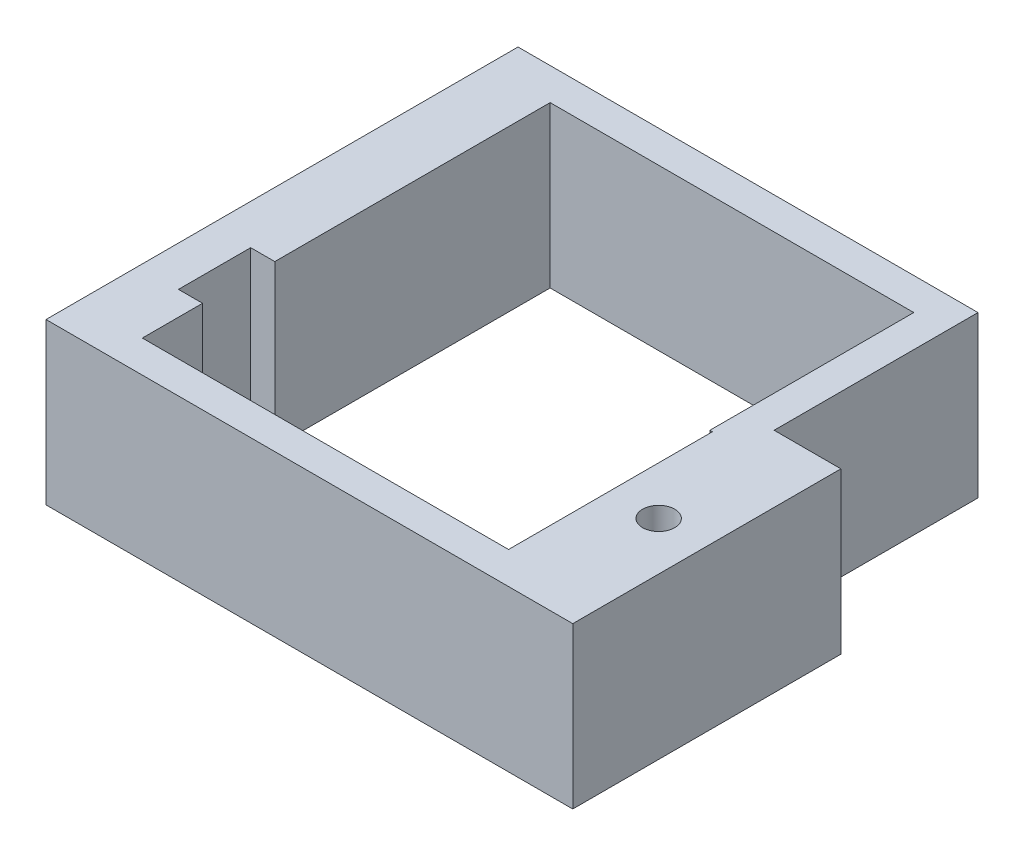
ISO-10303-21;
HEADER;
FILE_DESCRIPTION(('STEP AP214'),'2;1');
FILE_NAME('part.step','',(''),(''),'','','');
FILE_SCHEMA(('AUTOMOTIVE_DESIGN { 1 0 10303 214 1 1 1 1 }'));
ENDSEC;
DATA;
#1=APPLICATION_CONTEXT('core data for automotive mechanical design processes');
#2=APPLICATION_PROTOCOL_DEFINITION('international standard','automotive_design',2000,#1);
#3=PRODUCT_CONTEXT('',#1,'mechanical');
#4=PRODUCT('Part','Part','',(#3));
#5=PRODUCT_RELATED_PRODUCT_CATEGORY('part','',(#4));
#6=PRODUCT_DEFINITION_FORMATION('','',#4);
#7=PRODUCT_DEFINITION_CONTEXT('part definition',#1,'design');
#8=PRODUCT_DEFINITION('design','',#6,#7);
#9=PRODUCT_DEFINITION_SHAPE('','',#8);
#10=(LENGTH_UNIT() NAMED_UNIT(*) SI_UNIT(.MILLI.,.METRE.));
#11=(NAMED_UNIT(*) PLANE_ANGLE_UNIT() SI_UNIT($,.RADIAN.));
#12=(NAMED_UNIT(*) SI_UNIT($,.STERADIAN.) SOLID_ANGLE_UNIT());
#13=UNCERTAINTY_MEASURE_WITH_UNIT(LENGTH_MEASURE(1.E-05),#10,'distance_accuracy_value','');
#14=(GEOMETRIC_REPRESENTATION_CONTEXT(3) GLOBAL_UNCERTAINTY_ASSIGNED_CONTEXT((#13)) GLOBAL_UNIT_ASSIGNED_CONTEXT((#10,
#11,#12)) REPRESENTATION_CONTEXT('',''));
#15=CARTESIAN_POINT('',(0.,0.,0.));
#16=DIRECTION('',(0.,0.,1.));
#17=DIRECTION('',(1.,0.,0.));
#18=AXIS2_PLACEMENT_3D('',#15,#16,#17);
#19=CARTESIAN_POINT('',(4.,10.,-27.4));
#20=DIRECTION('',(1.,0.,0.));
#21=DIRECTION('',(0.,0.,-1.));
#22=AXIS2_PLACEMENT_3D('',#19,#20,#21);
#23=PLANE('',#22);
#24=DIRECTION('',(0.,1.,0.));
#25=VECTOR('',#24,1.);
#26=CARTESIAN_POINT('',(4.,0.,-5.75000000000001));
#27=LINE('',#26,#25);
#28=CARTESIAN_POINT('',(4.,0.,-5.75000000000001));
#29=VERTEX_POINT('',#28);
#30=CARTESIAN_POINT('',(4.,10.,-5.75000000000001));
#31=VERTEX_POINT('',#30);
#32=EDGE_CURVE('E179',#29,#31,#27,.T.);
#33=ORIENTED_EDGE('',*,*,#32,.T.);
#34=DIRECTION('',(0.,0.,1.));
#35=VECTOR('',#34,1.);
#36=CARTESIAN_POINT('',(4.,10.,-27.4));
#37=LINE('',#36,#35);
#38=CARTESIAN_POINT('',(4.,10.,-2.));
#39=VERTEX_POINT('',#38);
#40=EDGE_CURVE('E56',#31,#39,#37,.T.);
#41=ORIENTED_EDGE('',*,*,#40,.T.);
#42=DIRECTION('',(0.,-1.,0.));
#43=VECTOR('',#42,1.);
#44=CARTESIAN_POINT('',(4.,10.,-2.));
#45=LINE('',#44,#43);
#46=CARTESIAN_POINT('',(4.,0.,-2.));
#47=VERTEX_POINT('',#46);
#48=EDGE_CURVE('E220',#39,#47,#45,.T.);
#49=ORIENTED_EDGE('',*,*,#48,.T.);
#50=DIRECTION('',(0.,0.,1.));
#51=VECTOR('',#50,1.);
#52=CARTESIAN_POINT('',(4.,0.,-27.4));
#53=LINE('',#52,#51);
#54=EDGE_CURVE('E215',#29,#47,#53,.T.);
#55=ORIENTED_EDGE('',*,*,#54,.F.);
#56=EDGE_LOOP('',(#33,#41,#49,#55));
#57=FACE_BOUND('',#56,.T.);
#58=ADVANCED_FACE('F33',(#57),#23,.T.);
#59=CARTESIAN_POINT('',(0.,10.,0.));
#60=DIRECTION('',(0.,-1.,0.));
#61=DIRECTION('',(0.,0.,-1.));
#62=AXIS2_PLACEMENT_3D('',#59,#60,#61);
#63=PLANE('',#62);
#64=CARTESIAN_POINT('',(29.81,10.,-8.35));
#65=DIRECTION('',(0.,1.,0.));
#66=DIRECTION('',(0.,0.,1.));
#67=AXIS2_PLACEMENT_3D('',#64,#65,#66);
#68=CIRCLE('',#67,1.);
#69=CARTESIAN_POINT('',(29.81,10.,-7.35));
#70=VERTEX_POINT('',#69);
#71=EDGE_CURVE('E181',#70,#70,#68,.T.);
#72=ORIENTED_EDGE('',*,*,#71,.F.);
#73=EDGE_LOOP('',(#72));
#74=FACE_BOUND('',#73,.T.);
#75=DIRECTION('',(1.,0.,0.));
#76=VECTOR('',#75,1.);
#77=CARTESIAN_POINT('',(32.81,10.,0.));
#78=LINE('',#77,#76);
#79=CARTESIAN_POINT('',(0.,10.,0.));
#80=VERTEX_POINT('',#79);
#81=CARTESIAN_POINT('',(32.81,10.,0.));
#82=VERTEX_POINT('',#81);
#83=EDGE_CURVE('E231',#80,#82,#78,.T.);
#84=ORIENTED_EDGE('',*,*,#83,.T.);
#85=DIRECTION('',(0.,0.,-1.));
#86=VECTOR('',#85,1.);
#87=CARTESIAN_POINT('',(32.81,10.,-16.7));
#88=LINE('',#87,#86);
#89=CARTESIAN_POINT('',(32.81,10.,-16.7));
#90=VERTEX_POINT('',#89);
#91=EDGE_CURVE('E234',#82,#90,#88,.T.);
#92=ORIENTED_EDGE('',*,*,#91,.T.);
#93=DIRECTION('',(-1.,0.,0.));
#94=VECTOR('',#93,1.);
#95=CARTESIAN_POINT('',(28.65,10.,-16.7));
#96=LINE('',#95,#94);
#97=CARTESIAN_POINT('',(28.65,10.,-16.7));
#98=VERTEX_POINT('',#97);
#99=EDGE_CURVE('E237',#90,#98,#96,.T.);
#100=ORIENTED_EDGE('',*,*,#99,.T.);
#101=DIRECTION('',(0.,0.,-1.));
#102=VECTOR('',#101,1.);
#103=CARTESIAN_POINT('',(28.65,10.,-29.4));
#104=LINE('',#103,#102);
#105=CARTESIAN_POINT('',(28.65,10.,-29.4));
#106=VERTEX_POINT('',#105);
#107=EDGE_CURVE('E239',#98,#106,#104,.T.);
#108=ORIENTED_EDGE('',*,*,#107,.T.);
#109=DIRECTION('',(-1.,0.,0.));
#110=VECTOR('',#109,1.);
#111=CARTESIAN_POINT('',(0.,10.,-29.4));
#112=LINE('',#111,#110);
#113=CARTESIAN_POINT('',(0.,10.,-29.4));
#114=VERTEX_POINT('',#113);
#115=EDGE_CURVE('E241',#106,#114,#112,.T.);
#116=ORIENTED_EDGE('',*,*,#115,.T.);
#117=DIRECTION('',(0.,0.,1.));
#118=VECTOR('',#117,1.);
#119=CARTESIAN_POINT('',(0.,10.,0.));
#120=LINE('',#119,#118);
#121=EDGE_CURVE('E243',#114,#80,#120,.T.);
#122=ORIENTED_EDGE('',*,*,#121,.T.);
#123=EDGE_LOOP('',(#84,#92,#100,#108,#116,#122));
#124=FACE_BOUND('',#123,.T.);
#125=ORIENTED_EDGE('',*,*,#40,.F.);
#126=DIRECTION('',(1.,0.,0.));
#127=VECTOR('',#126,1.);
#128=CARTESIAN_POINT('',(4.,10.,-5.75000000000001));
#129=LINE('',#128,#127);
#130=CARTESIAN_POINT('',(2.5,10.,-5.75000000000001));
#131=VERTEX_POINT('',#130);
#132=EDGE_CURVE('E171',#131,#31,#129,.T.);
#133=ORIENTED_EDGE('',*,*,#132,.F.);
#134=DIRECTION('',(0.,0.,1.));
#135=VECTOR('',#134,1.);
#136=CARTESIAN_POINT('',(2.5,10.,-10.25));
#137=LINE('',#136,#135);
#138=CARTESIAN_POINT('',(2.5,10.,-10.25));
#139=VERTEX_POINT('',#138);
#140=EDGE_CURVE('E173',#139,#131,#137,.T.);
#141=ORIENTED_EDGE('',*,*,#140,.F.);
#142=DIRECTION('',(-1.,0.,0.));
#143=VECTOR('',#142,1.);
#144=CARTESIAN_POINT('',(4.,10.,-10.25));
#145=LINE('',#144,#143);
#146=CARTESIAN_POINT('',(4.,10.,-10.25));
#147=VERTEX_POINT('',#146);
#148=EDGE_CURVE('E150',#147,#139,#145,.T.);
#149=ORIENTED_EDGE('',*,*,#148,.F.);
#150=CARTESIAN_POINT('',(4.,10.,-27.4));
#151=VERTEX_POINT('',#150);
#152=EDGE_CURVE('E199',#151,#147,#37,.T.);
#153=ORIENTED_EDGE('',*,*,#152,.F.);
#154=DIRECTION('',(-1.,0.,0.));
#155=VECTOR('',#154,1.);
#156=CARTESIAN_POINT('',(26.65,10.,-27.4));
#157=LINE('',#156,#155);
#158=CARTESIAN_POINT('',(26.65,10.,-27.4));
#159=VERTEX_POINT('',#158);
#160=EDGE_CURVE('E197',#159,#151,#157,.T.);
#161=ORIENTED_EDGE('',*,*,#160,.F.);
#162=DIRECTION('',(0.,0.,-1.));
#163=VECTOR('',#162,1.);
#164=CARTESIAN_POINT('',(26.65,10.,-14.7));
#165=LINE('',#164,#163);
#166=CARTESIAN_POINT('',(26.65,10.,-14.7));
#167=VERTEX_POINT('',#166);
#168=EDGE_CURVE('E195',#167,#159,#165,.T.);
#169=ORIENTED_EDGE('',*,*,#168,.F.);
#170=DIRECTION('',(-1.,0.,0.));
#171=VECTOR('',#170,1.);
#172=CARTESIAN_POINT('',(26.81,10.,-14.7));
#173=LINE('',#172,#171);
#174=CARTESIAN_POINT('',(26.81,10.,-14.7));
#175=VERTEX_POINT('',#174);
#176=EDGE_CURVE('E192',#175,#167,#173,.T.);
#177=ORIENTED_EDGE('',*,*,#176,.F.);
#178=DIRECTION('',(0.,0.,-1.));
#179=VECTOR('',#178,1.);
#180=CARTESIAN_POINT('',(26.81,10.,-2.));
#181=LINE('',#180,#179);
#182=CARTESIAN_POINT('',(26.81,10.,-2.));
#183=VERTEX_POINT('',#182);
#184=EDGE_CURVE('E190',#183,#175,#181,.T.);
#185=ORIENTED_EDGE('',*,*,#184,.F.);
#186=DIRECTION('',(1.,0.,0.));
#187=VECTOR('',#186,1.);
#188=CARTESIAN_POINT('',(4.,10.,-2.));
#189=LINE('',#188,#187);
#190=EDGE_CURVE('E202',#39,#183,#189,.T.);
#191=ORIENTED_EDGE('',*,*,#190,.F.);
#192=EDGE_LOOP('',(#125,#133,#141,#149,#153,#161,#169,#177,#185,#191));
#193=FACE_BOUND('',#192,.T.);
#194=ADVANCED_FACE('F290',(#74,#124,#193),#63,.F.);
#195=CARTESIAN_POINT('',(0.,0.,0.));
#196=DIRECTION('',(0.,-1.,0.));
#197=DIRECTION('',(0.,0.,-1.));
#198=AXIS2_PLACEMENT_3D('',#195,#196,#197);
#199=PLANE('',#198);
#200=DIRECTION('',(1.,0.,0.));
#201=VECTOR('',#200,1.);
#202=CARTESIAN_POINT('',(4.,0.,-5.75000000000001));
#203=LINE('',#202,#201);
#204=CARTESIAN_POINT('',(2.5,0.,-5.75000000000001));
#205=VERTEX_POINT('',#204);
#206=EDGE_CURVE('E163',#205,#29,#203,.T.);
#207=ORIENTED_EDGE('',*,*,#206,.T.);
#208=ORIENTED_EDGE('',*,*,#54,.T.);
#209=DIRECTION('',(1.,0.,0.));
#210=VECTOR('',#209,1.);
#211=CARTESIAN_POINT('',(4.,0.,-2.));
#212=LINE('',#211,#210);
#213=CARTESIAN_POINT('',(26.81,0.,-2.));
#214=VERTEX_POINT('',#213);
#215=EDGE_CURVE('E193',#47,#214,#212,.T.);
#216=ORIENTED_EDGE('',*,*,#215,.T.);
#217=DIRECTION('',(0.,0.,-1.));
#218=VECTOR('',#217,1.);
#219=CARTESIAN_POINT('',(26.81,0.,-6.73909948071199));
#220=LINE('',#219,#218);
#221=CARTESIAN_POINT('',(26.81,0.,-14.7));
#222=VERTEX_POINT('',#221);
#223=EDGE_CURVE('E187',#214,#222,#220,.T.);
#224=ORIENTED_EDGE('',*,*,#223,.T.);
#225=DIRECTION('',(-1.,0.,0.));
#226=VECTOR('',#225,1.);
#227=CARTESIAN_POINT('',(26.81,0.,-14.7));
#228=LINE('',#227,#226);
#229=CARTESIAN_POINT('',(26.65,0.,-14.7));
#230=VERTEX_POINT('',#229);
#231=EDGE_CURVE('E207',#222,#230,#228,.T.);
#232=ORIENTED_EDGE('',*,*,#231,.T.);
#233=DIRECTION('',(0.,0.,-1.));
#234=VECTOR('',#233,1.);
#235=CARTESIAN_POINT('',(26.65,0.,-14.7));
#236=LINE('',#235,#234);
#237=CARTESIAN_POINT('',(26.65,0.,-27.4));
#238=VERTEX_POINT('',#237);
#239=EDGE_CURVE('E210',#230,#238,#236,.T.);
#240=ORIENTED_EDGE('',*,*,#239,.T.);
#241=DIRECTION('',(-1.,0.,0.));
#242=VECTOR('',#241,1.);
#243=CARTESIAN_POINT('',(26.65,0.,-27.4));
#244=LINE('',#243,#242);
#245=CARTESIAN_POINT('',(4.,0.,-27.4));
#246=VERTEX_POINT('',#245);
#247=EDGE_CURVE('E213',#238,#246,#244,.T.);
#248=ORIENTED_EDGE('',*,*,#247,.T.);
#249=CARTESIAN_POINT('',(4.,0.,-10.25));
#250=VERTEX_POINT('',#249);
#251=EDGE_CURVE('E170',#246,#250,#53,.T.);
#252=ORIENTED_EDGE('',*,*,#251,.T.);
#253=DIRECTION('',(-1.,0.,0.));
#254=VECTOR('',#253,1.);
#255=CARTESIAN_POINT('',(4.,0.,-10.25));
#256=LINE('',#255,#254);
#257=CARTESIAN_POINT('',(2.5,0.,-10.25));
#258=VERTEX_POINT('',#257);
#259=EDGE_CURVE('E48',#250,#258,#256,.T.);
#260=ORIENTED_EDGE('',*,*,#259,.T.);
#261=DIRECTION('',(0.,0.,1.));
#262=VECTOR('',#261,1.);
#263=CARTESIAN_POINT('',(2.5,0.,-10.25));
#264=LINE('',#263,#262);
#265=EDGE_CURVE('E158',#258,#205,#264,.T.);
#266=ORIENTED_EDGE('',*,*,#265,.T.);
#267=EDGE_LOOP('',(#207,#208,#216,#224,#232,#240,#248,#252,#260,#266));
#268=FACE_BOUND('',#267,.T.);
#269=CARTESIAN_POINT('',(29.81,0.,-8.35));
#270=DIRECTION('',(0.,1.,0.));
#271=DIRECTION('',(0.,0.,1.));
#272=AXIS2_PLACEMENT_3D('',#269,#270,#271);
#273=CIRCLE('',#272,1.);
#274=CARTESIAN_POINT('',(29.81,0.,-7.35));
#275=VERTEX_POINT('',#274);
#276=EDGE_CURVE('E184',#275,#275,#273,.T.);
#277=ORIENTED_EDGE('',*,*,#276,.T.);
#278=EDGE_LOOP('',(#277));
#279=FACE_BOUND('',#278,.T.);
#280=DIRECTION('',(1.,0.,0.));
#281=VECTOR('',#280,1.);
#282=CARTESIAN_POINT('',(32.81,0.,0.));
#283=LINE('',#282,#281);
#284=CARTESIAN_POINT('',(0.,0.,0.));
#285=VERTEX_POINT('',#284);
#286=CARTESIAN_POINT('',(32.81,0.,0.));
#287=VERTEX_POINT('',#286);
#288=EDGE_CURVE('E230',#285,#287,#283,.T.);
#289=ORIENTED_EDGE('',*,*,#288,.F.);
#290=DIRECTION('',(0.,0.,1.));
#291=VECTOR('',#290,1.);
#292=CARTESIAN_POINT('',(0.,0.,0.));
#293=LINE('',#292,#291);
#294=CARTESIAN_POINT('',(0.,0.,-29.4));
#295=VERTEX_POINT('',#294);
#296=EDGE_CURVE('E235',#295,#285,#293,.T.);
#297=ORIENTED_EDGE('',*,*,#296,.F.);
#298=DIRECTION('',(-1.,0.,0.));
#299=VECTOR('',#298,1.);
#300=CARTESIAN_POINT('',(0.,0.,-29.4));
#301=LINE('',#300,#299);
#302=CARTESIAN_POINT('',(28.65,0.,-29.4));
#303=VERTEX_POINT('',#302);
#304=EDGE_CURVE('E254',#303,#295,#301,.T.);
#305=ORIENTED_EDGE('',*,*,#304,.F.);
#306=DIRECTION('',(0.,0.,-1.));
#307=VECTOR('',#306,1.);
#308=CARTESIAN_POINT('',(28.65,0.,-29.4));
#309=LINE('',#308,#307);
#310=CARTESIAN_POINT('',(28.65,0.,-16.7));
#311=VERTEX_POINT('',#310);
#312=EDGE_CURVE('E252',#311,#303,#309,.T.);
#313=ORIENTED_EDGE('',*,*,#312,.F.);
#314=DIRECTION('',(-1.,0.,0.));
#315=VECTOR('',#314,1.);
#316=CARTESIAN_POINT('',(28.65,0.,-16.7));
#317=LINE('',#316,#315);
#318=CARTESIAN_POINT('',(32.81,0.,-16.7));
#319=VERTEX_POINT('',#318);
#320=EDGE_CURVE('E250',#319,#311,#317,.T.);
#321=ORIENTED_EDGE('',*,*,#320,.F.);
#322=DIRECTION('',(0.,0.,-1.));
#323=VECTOR('',#322,1.);
#324=CARTESIAN_POINT('',(32.81,0.,-16.7));
#325=LINE('',#324,#323);
#326=EDGE_CURVE('E248',#287,#319,#325,.T.);
#327=ORIENTED_EDGE('',*,*,#326,.F.);
#328=EDGE_LOOP('',(#289,#297,#305,#313,#321,#327));
#329=FACE_BOUND('',#328,.T.);
#330=ADVANCED_FACE('F166',(#268,#279,#329),#199,.T.);
#331=CARTESIAN_POINT('',(32.81,10.,0.));
#332=DIRECTION('',(0.,0.,-1.));
#333=DIRECTION('',(-1.,0.,0.));
#334=AXIS2_PLACEMENT_3D('',#331,#332,#333);
#335=PLANE('',#334);
#336=ORIENTED_EDGE('',*,*,#288,.T.);
#337=DIRECTION('',(0.,-1.,0.));
#338=VECTOR('',#337,1.);
#339=CARTESIAN_POINT('',(32.81,10.,0.));
#340=LINE('',#339,#338);
#341=EDGE_CURVE('E11',#82,#287,#340,.T.);
#342=ORIENTED_EDGE('',*,*,#341,.F.);
#343=ORIENTED_EDGE('',*,*,#83,.F.);
#344=DIRECTION('',(0.,-1.,0.));
#345=VECTOR('',#344,1.);
#346=CARTESIAN_POINT('',(0.,10.,0.));
#347=LINE('',#346,#345);
#348=EDGE_CURVE('E245',#80,#285,#347,.T.);
#349=ORIENTED_EDGE('',*,*,#348,.T.);
#350=EDGE_LOOP('',(#336,#342,#343,#349));
#351=FACE_BOUND('',#350,.T.);
#352=ADVANCED_FACE('F35',(#351),#335,.F.);
#353=CARTESIAN_POINT('',(32.81,10.,-16.7));
#354=DIRECTION('',(-1.,0.,0.));
#355=DIRECTION('',(0.,0.,1.));
#356=AXIS2_PLACEMENT_3D('',#353,#354,#355);
#357=PLANE('',#356);
#358=ORIENTED_EDGE('',*,*,#326,.T.);
#359=DIRECTION('',(0.,-1.,0.));
#360=VECTOR('',#359,1.);
#361=CARTESIAN_POINT('',(32.81,10.,-16.7));
#362=LINE('',#361,#360);
#363=EDGE_CURVE('E41',#90,#319,#362,.T.);
#364=ORIENTED_EDGE('',*,*,#363,.F.);
#365=ORIENTED_EDGE('',*,*,#91,.F.);
#366=ORIENTED_EDGE('',*,*,#341,.T.);
#367=EDGE_LOOP('',(#358,#364,#365,#366));
#368=FACE_BOUND('',#367,.T.);
#369=ADVANCED_FACE('F295',(#368),#357,.F.);
#370=CARTESIAN_POINT('',(28.65,10.,-16.7));
#371=DIRECTION('',(0.,0.,1.));
#372=DIRECTION('',(1.,0.,0.));
#373=AXIS2_PLACEMENT_3D('',#370,#371,#372);
#374=PLANE('',#373);
#375=ORIENTED_EDGE('',*,*,#320,.T.);
#376=DIRECTION('',(0.,-1.,0.));
#377=VECTOR('',#376,1.);
#378=CARTESIAN_POINT('',(28.65,10.,-16.7));
#379=LINE('',#378,#377);
#380=EDGE_CURVE('E265',#98,#311,#379,.T.);
#381=ORIENTED_EDGE('',*,*,#380,.F.);
#382=ORIENTED_EDGE('',*,*,#99,.F.);
#383=ORIENTED_EDGE('',*,*,#363,.T.);
#384=EDGE_LOOP('',(#375,#381,#382,#383));
#385=FACE_BOUND('',#384,.T.);
#386=ADVANCED_FACE('F272',(#385),#374,.F.);
#387=CARTESIAN_POINT('',(28.65,10.,-29.4));
#388=DIRECTION('',(-1.,0.,0.));
#389=DIRECTION('',(0.,0.,1.));
#390=AXIS2_PLACEMENT_3D('',#387,#388,#389);
#391=PLANE('',#390);
#392=ORIENTED_EDGE('',*,*,#312,.T.);
#393=DIRECTION('',(0.,-1.,0.));
#394=VECTOR('',#393,1.);
#395=CARTESIAN_POINT('',(28.65,10.,-29.4));
#396=LINE('',#395,#394);
#397=EDGE_CURVE('E262',#106,#303,#396,.T.);
#398=ORIENTED_EDGE('',*,*,#397,.F.);
#399=ORIENTED_EDGE('',*,*,#107,.F.);
#400=ORIENTED_EDGE('',*,*,#380,.T.);
#401=EDGE_LOOP('',(#392,#398,#399,#400));
#402=FACE_BOUND('',#401,.T.);
#403=ADVANCED_FACE('F282',(#402),#391,.F.);
#404=CARTESIAN_POINT('',(0.,10.,-29.4));
#405=DIRECTION('',(0.,0.,1.));
#406=DIRECTION('',(1.,0.,0.));
#407=AXIS2_PLACEMENT_3D('',#404,#405,#406);
#408=PLANE('',#407);
#409=ORIENTED_EDGE('',*,*,#304,.T.);
#410=DIRECTION('',(0.,-1.,0.));
#411=VECTOR('',#410,1.);
#412=CARTESIAN_POINT('',(0.,10.,-29.4));
#413=LINE('',#412,#411);
#414=EDGE_CURVE('E259',#114,#295,#413,.T.);
#415=ORIENTED_EDGE('',*,*,#414,.F.);
#416=ORIENTED_EDGE('',*,*,#115,.F.);
#417=ORIENTED_EDGE('',*,*,#397,.T.);
#418=EDGE_LOOP('',(#409,#415,#416,#417));
#419=FACE_BOUND('',#418,.T.);
#420=ADVANCED_FACE('F286',(#419),#408,.F.);
#421=CARTESIAN_POINT('',(0.,10.,0.));
#422=DIRECTION('',(1.,0.,0.));
#423=DIRECTION('',(0.,0.,-1.));
#424=AXIS2_PLACEMENT_3D('',#421,#422,#423);
#425=PLANE('',#424);
#426=ORIENTED_EDGE('',*,*,#296,.T.);
#427=ORIENTED_EDGE('',*,*,#348,.F.);
#428=ORIENTED_EDGE('',*,*,#121,.F.);
#429=ORIENTED_EDGE('',*,*,#414,.T.);
#430=EDGE_LOOP('',(#426,#427,#428,#429));
#431=FACE_BOUND('',#430,.T.);
#432=ADVANCED_FACE('F298',(#431),#425,.F.);
#433=CARTESIAN_POINT('',(26.81,10.,-6.73909948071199));
#434=DIRECTION('',(-1.,0.,0.));
#435=DIRECTION('',(0.,0.,1.));
#436=AXIS2_PLACEMENT_3D('',#433,#434,#435);
#437=PLANE('',#436);
#438=ORIENTED_EDGE('',*,*,#223,.F.);
#439=DIRECTION('',(0.,-1.,0.));
#440=VECTOR('',#439,1.);
#441=CARTESIAN_POINT('',(26.81,10.,-2.));
#442=LINE('',#441,#440);
#443=EDGE_CURVE('E204',#183,#214,#442,.T.);
#444=ORIENTED_EDGE('',*,*,#443,.F.);
#445=ORIENTED_EDGE('',*,*,#184,.T.);
#446=DIRECTION('',(0.,-1.,0.));
#447=VECTOR('',#446,1.);
#448=CARTESIAN_POINT('',(26.81,10.,-14.7));
#449=LINE('',#448,#447);
#450=EDGE_CURVE('E228',#175,#222,#449,.T.);
#451=ORIENTED_EDGE('',*,*,#450,.T.);
#452=EDGE_LOOP('',(#438,#444,#445,#451));
#453=FACE_BOUND('',#452,.T.);
#454=ADVANCED_FACE('F300',(#453),#437,.T.);
#455=CARTESIAN_POINT('',(26.81,10.,-14.7));
#456=DIRECTION('',(0.,0.,1.));
#457=DIRECTION('',(1.,0.,0.));
#458=AXIS2_PLACEMENT_3D('',#455,#456,#457);
#459=PLANE('',#458);
#460=ORIENTED_EDGE('',*,*,#231,.F.);
#461=ORIENTED_EDGE('',*,*,#450,.F.);
#462=ORIENTED_EDGE('',*,*,#176,.T.);
#463=DIRECTION('',(0.,-1.,0.));
#464=VECTOR('',#463,1.);
#465=CARTESIAN_POINT('',(26.65,10.,-14.7));
#466=LINE('',#465,#464);
#467=EDGE_CURVE('E226',#167,#230,#466,.T.);
#468=ORIENTED_EDGE('',*,*,#467,.T.);
#469=EDGE_LOOP('',(#460,#461,#462,#468));
#470=FACE_BOUND('',#469,.T.);
#471=ADVANCED_FACE('F306',(#470),#459,.T.);
#472=CARTESIAN_POINT('',(26.65,10.,-14.7));
#473=DIRECTION('',(-1.,0.,0.));
#474=DIRECTION('',(0.,0.,1.));
#475=AXIS2_PLACEMENT_3D('',#472,#473,#474);
#476=PLANE('',#475);
#477=ORIENTED_EDGE('',*,*,#239,.F.);
#478=ORIENTED_EDGE('',*,*,#467,.F.);
#479=ORIENTED_EDGE('',*,*,#168,.T.);
#480=DIRECTION('',(0.,-1.,0.));
#481=VECTOR('',#480,1.);
#482=CARTESIAN_POINT('',(26.65,10.,-27.4));
#483=LINE('',#482,#481);
#484=EDGE_CURVE('E224',#159,#238,#483,.T.);
#485=ORIENTED_EDGE('',*,*,#484,.T.);
#486=EDGE_LOOP('',(#477,#478,#479,#485));
#487=FACE_BOUND('',#486,.T.);
#488=ADVANCED_FACE('F331',(#487),#476,.T.);
#489=CARTESIAN_POINT('',(26.65,10.,-27.4));
#490=DIRECTION('',(0.,0.,1.));
#491=DIRECTION('',(1.,0.,0.));
#492=AXIS2_PLACEMENT_3D('',#489,#490,#491);
#493=PLANE('',#492);
#494=ORIENTED_EDGE('',*,*,#247,.F.);
#495=ORIENTED_EDGE('',*,*,#484,.F.);
#496=ORIENTED_EDGE('',*,*,#160,.T.);
#497=DIRECTION('',(0.,-1.,0.));
#498=VECTOR('',#497,1.);
#499=CARTESIAN_POINT('',(4.,10.,-27.4));
#500=LINE('',#499,#498);
#501=EDGE_CURVE('E222',#151,#246,#500,.T.);
#502=ORIENTED_EDGE('',*,*,#501,.T.);
#503=EDGE_LOOP('',(#494,#495,#496,#502));
#504=FACE_BOUND('',#503,.T.);
#505=ADVANCED_FACE('F323',(#504),#493,.T.);
#506=DIRECTION('',(0.,1.,0.));
#507=VECTOR('',#506,1.);
#508=CARTESIAN_POINT('',(4.,0.,-10.25));
#509=LINE('',#508,#507);
#510=EDGE_CURVE('E155',#250,#147,#509,.T.);
#511=ORIENTED_EDGE('',*,*,#510,.F.);
#512=ORIENTED_EDGE('',*,*,#251,.F.);
#513=ORIENTED_EDGE('',*,*,#501,.F.);
#514=ORIENTED_EDGE('',*,*,#152,.T.);
#515=EDGE_LOOP('',(#511,#512,#513,#514));
#516=FACE_BOUND('',#515,.T.);
#517=ADVANCED_FACE('F313',(#516),#23,.T.);
#518=CARTESIAN_POINT('',(4.,10.,-2.));
#519=DIRECTION('',(0.,0.,-1.));
#520=DIRECTION('',(-1.,0.,0.));
#521=AXIS2_PLACEMENT_3D('',#518,#519,#520);
#522=PLANE('',#521);
#523=ORIENTED_EDGE('',*,*,#215,.F.);
#524=ORIENTED_EDGE('',*,*,#48,.F.);
#525=ORIENTED_EDGE('',*,*,#190,.T.);
#526=ORIENTED_EDGE('',*,*,#443,.T.);
#527=EDGE_LOOP('',(#523,#524,#525,#526));
#528=FACE_BOUND('',#527,.T.);
#529=ADVANCED_FACE('F322',(#528),#522,.T.);
#530=CARTESIAN_POINT('',(29.81,0.,-8.35));
#531=DIRECTION('',(0.,1.,0.));
#532=DIRECTION('',(0.,0.,1.));
#533=AXIS2_PLACEMENT_3D('',#530,#531,#532);
#534=CYLINDRICAL_SURFACE('',#533,1.);
#535=ORIENTED_EDGE('',*,*,#276,.F.);
#536=EDGE_LOOP('',(#535));
#537=FACE_BOUND('',#536,.T.);
#538=ORIENTED_EDGE('',*,*,#71,.T.);
#539=EDGE_LOOP('',(#538));
#540=FACE_BOUND('',#539,.T.);
#541=ADVANCED_FACE('F329',(#537,#540),#534,.F.);
#542=CARTESIAN_POINT('',(4.,0.,-5.75000000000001));
#543=DIRECTION('',(0.,0.,1.));
#544=DIRECTION('',(1.,0.,0.));
#545=AXIS2_PLACEMENT_3D('',#542,#543,#544);
#546=PLANE('',#545);
#547=ORIENTED_EDGE('',*,*,#132,.T.);
#548=ORIENTED_EDGE('',*,*,#32,.F.);
#549=ORIENTED_EDGE('',*,*,#206,.F.);
#550=DIRECTION('',(0.,1.,0.));
#551=VECTOR('',#550,1.);
#552=CARTESIAN_POINT('',(2.5,0.,-5.75000000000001));
#553=LINE('',#552,#551);
#554=EDGE_CURVE('E154',#205,#131,#553,.T.);
#555=ORIENTED_EDGE('',*,*,#554,.T.);
#556=EDGE_LOOP('',(#547,#548,#549,#555));
#557=FACE_BOUND('',#556,.T.);
#558=ADVANCED_FACE('F339',(#557),#546,.F.);
#559=CARTESIAN_POINT('',(2.5,0.,-10.25));
#560=DIRECTION('',(-1.,0.,0.));
#561=DIRECTION('',(0.,0.,1.));
#562=AXIS2_PLACEMENT_3D('',#559,#560,#561);
#563=PLANE('',#562);
#564=ORIENTED_EDGE('',*,*,#140,.T.);
#565=ORIENTED_EDGE('',*,*,#554,.F.);
#566=ORIENTED_EDGE('',*,*,#265,.F.);
#567=DIRECTION('',(0.,1.,0.));
#568=VECTOR('',#567,1.);
#569=CARTESIAN_POINT('',(2.5,0.,-10.25));
#570=LINE('',#569,#568);
#571=EDGE_CURVE('E146',#258,#139,#570,.T.);
#572=ORIENTED_EDGE('',*,*,#571,.T.);
#573=EDGE_LOOP('',(#564,#565,#566,#572));
#574=FACE_BOUND('',#573,.T.);
#575=ADVANCED_FACE('F159',(#574),#563,.F.);
#576=CARTESIAN_POINT('',(4.,0.,-10.25));
#577=DIRECTION('',(0.,0.,-1.));
#578=DIRECTION('',(-1.,0.,0.));
#579=AXIS2_PLACEMENT_3D('',#576,#577,#578);
#580=PLANE('',#579);
#581=ORIENTED_EDGE('',*,*,#148,.T.);
#582=ORIENTED_EDGE('',*,*,#571,.F.);
#583=ORIENTED_EDGE('',*,*,#259,.F.);
#584=ORIENTED_EDGE('',*,*,#510,.T.);
#585=EDGE_LOOP('',(#581,#582,#583,#584));
#586=FACE_BOUND('',#585,.T.);
#587=ADVANCED_FACE('F148',(#586),#580,.F.);
#588=CLOSED_SHELL('',(#58,#194,#330,#352,#369,#386,#403,#420,#432,#454,#471,#488,#505,#517,#529,
#541,#558,#575,#587));
#589=MANIFOLD_SOLID_BREP('B2',#588);
#590=ADVANCED_BREP_SHAPE_REPRESENTATION('',(#18,#589),#14);
#591=SHAPE_DEFINITION_REPRESENTATION(#9,#590);
ENDSEC;
END-ISO-10303-21;
